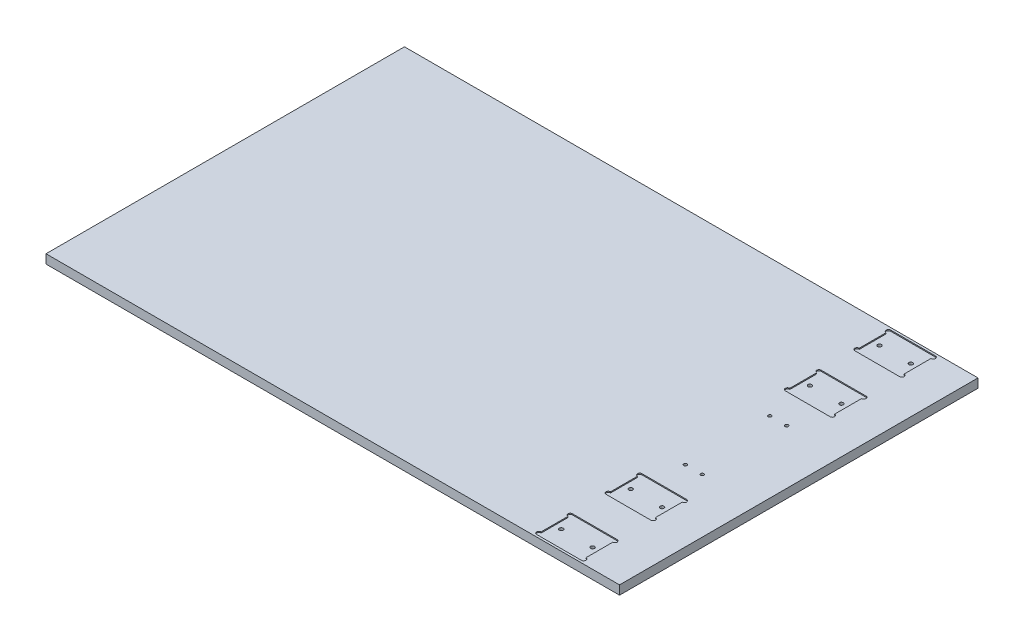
from build123d import *

# Parameters (mm, degrees)
SKETCH2_W           = 406.4
SKETCH2_H           = 6.35
BOSS_EXTRUDE1_DEPTH = 254
SKETCH3_R           = 1.3462
SKETCH3_R_2         = 1.1303
CUT_EXTRUDE1_DEPTH  = 480.288308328
CUT_EXTRUDE3_DEPTH  = 0.762


with BuildPart() as part:
    # Sketch2 → Boss-Extrude1 (new body)
    with BuildSketch(Plane.XY):
        with Locations((203.2, 3.175)):
            Rectangle(SKETCH2_W, SKETCH2_H)
    extrude(amount=-BOSS_EXTRUDE1_DEPTH)

    # Sketch3 → Cut-Extrude1 (cut, through all)
    with BuildSketch(Plane(origin=(0, 6.35, 0), x_dir=(1, 0, 0), z_dir=(0, 1, 0))):
        with Locations(Location((350.8248, 239.7252, 0), (0, 0, 270))):
            Circle(SKETCH3_R)
        with Locations(Location((373.0752, 239.7252, 0), (0, 0, 270))):
            Circle(SKETCH3_R)
        with Locations(Location((373.0752, 190.5, 0), (0, 0, 270))):
            Circle(SKETCH3_R)
        with Locations(Location((350.8248, 190.5, 0), (0, 0, 270))):
            Circle(SKETCH3_R)
        with Locations(Location((355.9556, 156.9212, 0), (0, 0, 270))):
            Circle(SKETCH3_R_2)
        with Locations(Location((367.9444, 156.9212, 0), (0, 0, 270))):
            Circle(SKETCH3_R_2)
        with Locations(Location((367.9444, 97.0788, 0), (0, 0, 270))):
            Circle(SKETCH3_R_2)
        with Locations(Location((355.9556, 97.0788, 0), (0, 0, 270))):
            Circle(SKETCH3_R_2)
        with Locations(Location((373.0752, 63.5, 0), (0, 0, 90))):
            Circle(SKETCH3_R)
        with Locations(Location((350.8248, 63.5, 0), (0, 0, 90))):
            Circle(SKETCH3_R)
        with Locations(Location((350.8248, 14.2748, 0), (0, 0, 90))):
            Circle(SKETCH3_R)
        with Locations(Location((373.0752, 14.2748, 0), (0, 0, 90))):
            Circle(SKETCH3_R)
    extrude(amount=-CUT_EXTRUDE1_DEPTH, mode=Mode.SUBTRACT)

    # Sketch4 → Cut-Extrude3 (cut)
    with BuildSketch(Plane(origin=(0, 6.35, 0), x_dir=(1, 0, 0), z_dir=(0, 1, 0))):
        with BuildLine():
            Line((346.075, 252.4252), (377.825, 252.4252))
            ThreePointArc((377.825, 252.4252), (379.4125, 250.8377), (377.825, 249.2502))
            Line((377.825, 249.2502), (377.825, 230.2002))
            ThreePointArc((377.825, 230.2002), (379.4125, 228.6127), (377.825, 227.0252))
            Line((377.825, 227.0252), (346.075, 227.0252))
            ThreePointArc((346.075, 227.0252), (344.4875, 228.6127), (346.075, 230.2002))
            Line((346.075, 230.2002), (346.075, 249.2502))
            ThreePointArc((346.075, 249.2502), (344.4875, 250.8377), (346.075, 252.4252))
        make_face()
        with BuildLine():
            Line((346.075, 203.2), (377.825, 203.2))
            ThreePointArc((377.825, 203.2), (379.4125, 201.6125), (377.825, 200.025))
            Line((377.825, 200.025), (377.825, 180.975))
            ThreePointArc((377.825, 180.975), (379.4125, 179.3875), (377.825, 177.8))
            Line((377.825, 177.8), (346.075, 177.8))
            ThreePointArc((346.075, 177.8), (344.4875, 179.3875), (346.075, 180.975))
            Line((346.075, 180.975), (346.075, 200.025))
            ThreePointArc((346.075, 200.025), (344.4875, 201.6125), (346.075, 203.2))
        make_face()
        with BuildLine():
            Line((346.075, 4.7498), (346.075, 23.7998))
            ThreePointArc((346.075, 23.7998), (344.4875, 25.3873), (346.075, 26.9748))
            Line((346.075, 26.9748), (377.825, 26.9748))
            ThreePointArc((377.825, 26.9748), (379.4125, 25.3873), (377.825, 23.7998))
            Line((377.825, 23.7998), (377.825, 4.7498))
            ThreePointArc((377.825, 4.7498), (379.4125, 3.1623), (377.825, 1.5748))
            Line((377.825, 1.5748), (346.075, 1.5748))
            ThreePointArc((346.075, 1.5748), (344.4875, 3.1623), (346.075, 4.7498))
        make_face()
        with BuildLine():
            Line((346.075, 53.975), (346.075, 73.025))
            ThreePointArc((346.075, 73.025), (344.4875, 74.6125), (346.075, 76.2))
            Line((346.075, 76.2), (377.825, 76.2))
            ThreePointArc((377.825, 76.2), (379.4125, 74.6125), (377.825, 73.025))
            Line((377.825, 73.025), (377.825, 53.975))
            ThreePointArc((377.825, 53.975), (379.4125, 52.3875), (377.825, 50.8))
            Line((377.825, 50.8), (346.075, 50.8))
            ThreePointArc((346.075, 50.8), (344.4875, 52.3875), (346.075, 53.975))
        make_face()
    extrude(amount=-CUT_EXTRUDE3_DEPTH, mode=Mode.SUBTRACT)


solid = part.part
